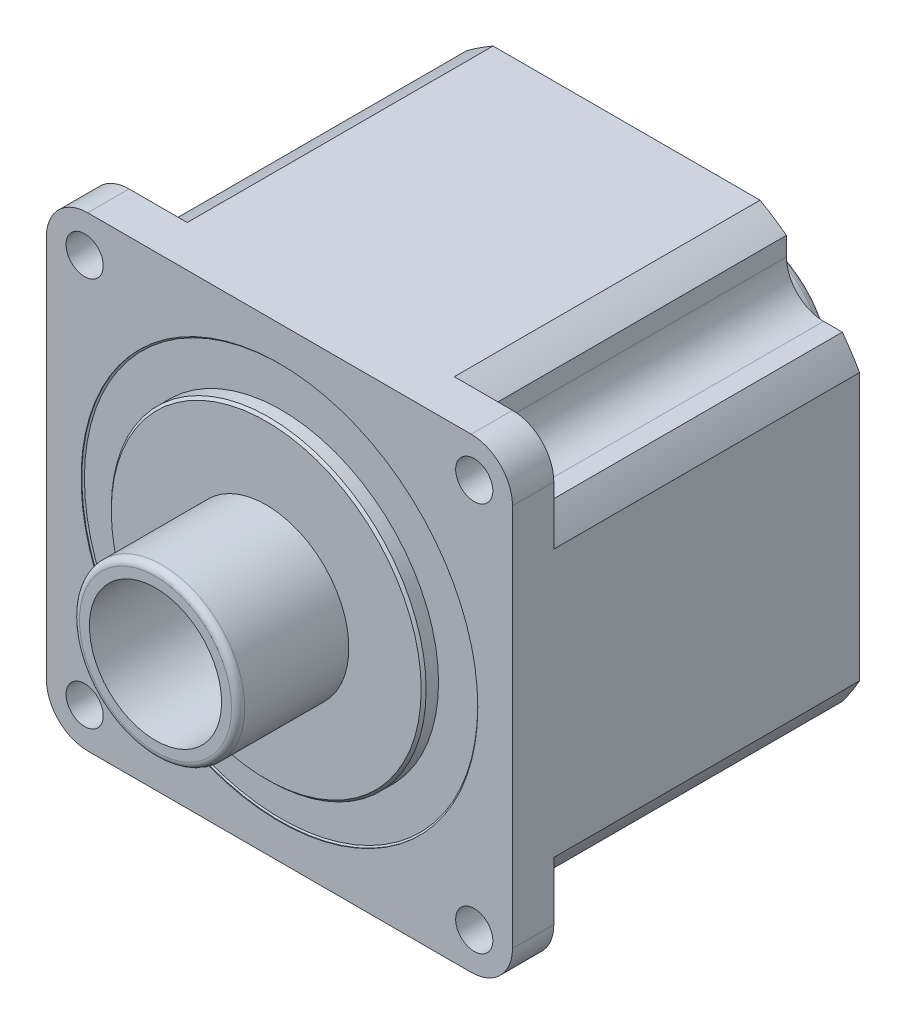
ISO-10303-21;
HEADER;
FILE_DESCRIPTION(('STEP AP214'),'2;1');
FILE_NAME('part.step','',(''),(''),'','','');
FILE_SCHEMA(('AUTOMOTIVE_DESIGN { 1 0 10303 214 1 1 1 1 }'));
ENDSEC;
DATA;
#1=APPLICATION_CONTEXT('core data for automotive mechanical design processes');
#2=APPLICATION_PROTOCOL_DEFINITION('international standard','automotive_design',2000,#1);
#3=PRODUCT_CONTEXT('',#1,'mechanical');
#4=PRODUCT('Part','Part','',(#3));
#5=PRODUCT_RELATED_PRODUCT_CATEGORY('part','',(#4));
#6=PRODUCT_DEFINITION_FORMATION('','',#4);
#7=PRODUCT_DEFINITION_CONTEXT('part definition',#1,'design');
#8=PRODUCT_DEFINITION('design','',#6,#7);
#9=PRODUCT_DEFINITION_SHAPE('','',#8);
#10=(LENGTH_UNIT() NAMED_UNIT(*) SI_UNIT(.MILLI.,.METRE.));
#11=(NAMED_UNIT(*) PLANE_ANGLE_UNIT() SI_UNIT($,.RADIAN.));
#12=(NAMED_UNIT(*) SI_UNIT($,.STERADIAN.) SOLID_ANGLE_UNIT());
#13=UNCERTAINTY_MEASURE_WITH_UNIT(LENGTH_MEASURE(1.E-05),#10,'distance_accuracy_value','');
#14=(GEOMETRIC_REPRESENTATION_CONTEXT(3) GLOBAL_UNCERTAINTY_ASSIGNED_CONTEXT((#13)) GLOBAL_UNIT_ASSIGNED_CONTEXT((#10,
#11,#12)) REPRESENTATION_CONTEXT('',''));
#15=CARTESIAN_POINT('',(0.,0.,0.));
#16=DIRECTION('',(0.,0.,1.));
#17=DIRECTION('',(1.,0.,0.));
#18=AXIS2_PLACEMENT_3D('',#15,#16,#17);
#19=CARTESIAN_POINT('',(0.,0.,-43.6));
#20=DIRECTION('',(0.,0.,-1.));
#21=DIRECTION('',(-1.,0.,0.));
#22=AXIS2_PLACEMENT_3D('',#19,#20,#21);
#23=PLANE('',#22);
#24=DIRECTION('',(0.,1.,0.));
#25=VECTOR('',#24,1.);
#26=CARTESIAN_POINT('',(-28.2,0.,-43.6));
#27=LINE('',#26,#25);
#28=CARTESIAN_POINT('',(-28.2,-16.1558039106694,-43.6));
#29=VERTEX_POINT('',#28);
#30=CARTESIAN_POINT('',(-28.2,16.1558039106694,-43.6));
#31=VERTEX_POINT('',#30);
#32=EDGE_CURVE('E259',#29,#31,#27,.T.);
#33=ORIENTED_EDGE('',*,*,#32,.T.);
#34=CARTESIAN_POINT('',(0.,0.,-43.6));
#35=DIRECTION('',(0.,0.,-1.));
#36=DIRECTION('',(-1.,0.,0.));
#37=AXIS2_PLACEMENT_3D('',#34,#35,#36);
#38=CIRCLE('',#37,32.5);
#39=CARTESIAN_POINT('',(-26.1118268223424,19.35,-43.6));
#40=VERTEX_POINT('',#39);
#41=EDGE_CURVE('E248',#31,#40,#38,.T.);
#42=ORIENTED_EDGE('',*,*,#41,.T.);
#43=DIRECTION('',(-1.,0.,0.));
#44=VECTOR('',#43,1.);
#45=CARTESIAN_POINT('',(0.,19.35,-43.6));
#46=LINE('',#45,#44);
#47=CARTESIAN_POINT('',(-23.85,19.35,-43.6));
#48=VERTEX_POINT('',#47);
#49=EDGE_CURVE('E258',#48,#40,#46,.T.);
#50=ORIENTED_EDGE('',*,*,#49,.F.);
#51=CARTESIAN_POINT('',(-23.85,23.85,-43.6));
#52=DIRECTION('',(0.,0.,-1.));
#53=DIRECTION('',(-1.,0.,0.));
#54=AXIS2_PLACEMENT_3D('',#51,#52,#53);
#55=CIRCLE('',#54,4.5);
#56=CARTESIAN_POINT('',(-19.35,23.85,-43.6));
#57=VERTEX_POINT('',#56);
#58=EDGE_CURVE('E377',#48,#57,#55,.F.);
#59=ORIENTED_EDGE('',*,*,#58,.T.);
#60=DIRECTION('',(0.,-1.,0.));
#61=VECTOR('',#60,1.);
#62=CARTESIAN_POINT('',(-19.35,0.,-43.6));
#63=LINE('',#62,#61);
#64=CARTESIAN_POINT('',(-19.35,26.1118268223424,-43.6));
#65=VERTEX_POINT('',#64);
#66=EDGE_CURVE('E588',#65,#57,#63,.T.);
#67=ORIENTED_EDGE('',*,*,#66,.F.);
#68=CARTESIAN_POINT('',(-16.1558039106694,28.2,-43.6));
#69=VERTEX_POINT('',#68);
#70=EDGE_CURVE('E262',#65,#69,#38,.T.);
#71=ORIENTED_EDGE('',*,*,#70,.T.);
#72=DIRECTION('',(1.,0.,0.));
#73=VECTOR('',#72,1.);
#74=CARTESIAN_POINT('',(0.,28.2,-43.6));
#75=LINE('',#74,#73);
#76=CARTESIAN_POINT('',(16.1558039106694,28.2,-43.6));
#77=VERTEX_POINT('',#76);
#78=EDGE_CURVE('E591',#69,#77,#75,.T.);
#79=ORIENTED_EDGE('',*,*,#78,.T.);
#80=CARTESIAN_POINT('',(19.35,26.1118268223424,-43.6));
#81=VERTEX_POINT('',#80);
#82=EDGE_CURVE('E593',#77,#81,#38,.T.);
#83=ORIENTED_EDGE('',*,*,#82,.T.);
#84=DIRECTION('',(0.,-1.,0.));
#85=VECTOR('',#84,1.);
#86=CARTESIAN_POINT('',(19.35,0.,-43.6));
#87=LINE('',#86,#85);
#88=CARTESIAN_POINT('',(19.35,23.85,-43.6));
#89=VERTEX_POINT('',#88);
#90=EDGE_CURVE('E594',#81,#89,#87,.T.);
#91=ORIENTED_EDGE('',*,*,#90,.T.);
#92=CARTESIAN_POINT('',(23.85,23.85,-43.6));
#93=DIRECTION('',(0.,0.,-1.));
#94=DIRECTION('',(-1.,0.,0.));
#95=AXIS2_PLACEMENT_3D('',#92,#93,#94);
#96=CIRCLE('',#95,4.5);
#97=CARTESIAN_POINT('',(23.85,19.35,-43.6));
#98=VERTEX_POINT('',#97);
#99=EDGE_CURVE('E379',#89,#98,#96,.F.);
#100=ORIENTED_EDGE('',*,*,#99,.T.);
#101=DIRECTION('',(-1.,0.,0.));
#102=VECTOR('',#101,1.);
#103=CARTESIAN_POINT('',(0.,19.35,-43.6));
#104=LINE('',#103,#102);
#105=CARTESIAN_POINT('',(26.1118268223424,19.35,-43.6));
#106=VERTEX_POINT('',#105);
#107=EDGE_CURVE('E596',#106,#98,#104,.T.);
#108=ORIENTED_EDGE('',*,*,#107,.F.);
#109=CARTESIAN_POINT('',(28.2,16.1558039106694,-43.6));
#110=VERTEX_POINT('',#109);
#111=EDGE_CURVE('E599',#106,#110,#38,.T.);
#112=ORIENTED_EDGE('',*,*,#111,.T.);
#113=DIRECTION('',(0.,-1.,0.));
#114=VECTOR('',#113,1.);
#115=CARTESIAN_POINT('',(28.2,0.,-43.6));
#116=LINE('',#115,#114);
#117=CARTESIAN_POINT('',(28.2,-16.1558039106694,-43.6));
#118=VERTEX_POINT('',#117);
#119=EDGE_CURVE('E600',#110,#118,#116,.T.);
#120=ORIENTED_EDGE('',*,*,#119,.T.);
#121=CARTESIAN_POINT('',(26.1118268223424,-19.35,-43.6));
#122=VERTEX_POINT('',#121);
#123=EDGE_CURVE('E602',#118,#122,#38,.T.);
#124=ORIENTED_EDGE('',*,*,#123,.T.);
#125=DIRECTION('',(-1.,0.,0.));
#126=VECTOR('',#125,1.);
#127=CARTESIAN_POINT('',(0.,-19.35,-43.6));
#128=LINE('',#127,#126);
#129=CARTESIAN_POINT('',(23.85,-19.35,-43.6));
#130=VERTEX_POINT('',#129);
#131=EDGE_CURVE('E603',#122,#130,#128,.T.);
#132=ORIENTED_EDGE('',*,*,#131,.T.);
#133=CARTESIAN_POINT('',(23.85,-23.85,-43.6));
#134=DIRECTION('',(0.,0.,-1.));
#135=DIRECTION('',(-1.,0.,0.));
#136=AXIS2_PLACEMENT_3D('',#133,#134,#135);
#137=CIRCLE('',#136,4.5);
#138=CARTESIAN_POINT('',(19.35,-23.85,-43.6));
#139=VERTEX_POINT('',#138);
#140=EDGE_CURVE('E373',#130,#139,#137,.F.);
#141=ORIENTED_EDGE('',*,*,#140,.T.);
#142=DIRECTION('',(0.,-1.,0.));
#143=VECTOR('',#142,1.);
#144=CARTESIAN_POINT('',(19.35,0.,-43.6));
#145=LINE('',#144,#143);
#146=CARTESIAN_POINT('',(19.35,-26.1118268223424,-43.6));
#147=VERTEX_POINT('',#146);
#148=EDGE_CURVE('E606',#139,#147,#145,.T.);
#149=ORIENTED_EDGE('',*,*,#148,.T.);
#150=CARTESIAN_POINT('',(16.1558039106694,-28.2,-43.6));
#151=VERTEX_POINT('',#150);
#152=EDGE_CURVE('E608',#147,#151,#38,.T.);
#153=ORIENTED_EDGE('',*,*,#152,.T.);
#154=DIRECTION('',(-1.,0.,0.));
#155=VECTOR('',#154,1.);
#156=CARTESIAN_POINT('',(0.,-28.2,-43.6));
#157=LINE('',#156,#155);
#158=CARTESIAN_POINT('',(-16.1558039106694,-28.2,-43.6));
#159=VERTEX_POINT('',#158);
#160=EDGE_CURVE('E609',#151,#159,#157,.T.);
#161=ORIENTED_EDGE('',*,*,#160,.T.);
#162=CARTESIAN_POINT('',(-19.35,-26.1118268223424,-43.6));
#163=VERTEX_POINT('',#162);
#164=EDGE_CURVE('E610',#159,#163,#38,.T.);
#165=ORIENTED_EDGE('',*,*,#164,.T.);
#166=DIRECTION('',(0.,-1.,0.));
#167=VECTOR('',#166,1.);
#168=CARTESIAN_POINT('',(-19.35,0.,-43.6));
#169=LINE('',#168,#167);
#170=CARTESIAN_POINT('',(-19.35,-23.85,-43.6));
#171=VERTEX_POINT('',#170);
#172=EDGE_CURVE('E611',#171,#163,#169,.T.);
#173=ORIENTED_EDGE('',*,*,#172,.F.);
#174=CARTESIAN_POINT('',(-23.85,-23.85,-43.6));
#175=DIRECTION('',(0.,0.,-1.));
#176=DIRECTION('',(-1.,0.,0.));
#177=AXIS2_PLACEMENT_3D('',#174,#175,#176);
#178=CIRCLE('',#177,4.5);
#179=CARTESIAN_POINT('',(-23.85,-19.35,-43.6));
#180=VERTEX_POINT('',#179);
#181=EDGE_CURVE('E375',#171,#180,#178,.F.);
#182=ORIENTED_EDGE('',*,*,#181,.T.);
#183=DIRECTION('',(-1.,0.,0.));
#184=VECTOR('',#183,1.);
#185=CARTESIAN_POINT('',(0.,-19.35,-43.6));
#186=LINE('',#185,#184);
#187=CARTESIAN_POINT('',(-26.1118268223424,-19.35,-43.6));
#188=VERTEX_POINT('',#187);
#189=EDGE_CURVE('E298',#180,#188,#186,.T.);
#190=ORIENTED_EDGE('',*,*,#189,.T.);
#191=EDGE_CURVE('E261',#188,#29,#38,.T.);
#192=ORIENTED_EDGE('',*,*,#191,.T.);
#193=EDGE_LOOP('',(#33,#42,#50,#59,#67,#71,#79,#83,#91,#100,#108,#112,#120,#124,#132,#141,#149,
#153,#161,#165,#173,#182,#190,#192));
#194=FACE_BOUND('',#193,.T.);
#195=CARTESIAN_POINT('',(0.,0.,-43.6));
#196=DIRECTION('',(0.,0.,-1.));
#197=DIRECTION('',(-1.,0.,0.));
#198=AXIS2_PLACEMENT_3D('',#195,#196,#197);
#199=CIRCLE('',#198,10.);
#200=CARTESIAN_POINT('',(-10.,0.,-43.6));
#201=VERTEX_POINT('',#200);
#202=EDGE_CURVE('E578',#201,#201,#199,.T.);
#203=ORIENTED_EDGE('',*,*,#202,.F.);
#204=EDGE_LOOP('',(#203));
#205=FACE_BOUND('',#204,.T.);
#206=ADVANCED_FACE('F37',(#194,#205),#23,.T.);
#207=CARTESIAN_POINT('',(0.,0.,13.4));
#208=DIRECTION('',(0.,0.,-1.));
#209=DIRECTION('',(-1.,0.,0.));
#210=AXIS2_PLACEMENT_3D('',#207,#208,#209);
#211=CYLINDRICAL_SURFACE('',#210,10.);
#212=CARTESIAN_POINT('',(0.,0.,12.6));
#213=DIRECTION('',(0.,0.,1.));
#214=DIRECTION('',(1.,0.,0.));
#215=AXIS2_PLACEMENT_3D('',#212,#213,#214);
#216=CIRCLE('',#215,10.);
#217=CARTESIAN_POINT('',(10.,0.,12.6));
#218=VERTEX_POINT('',#217);
#219=EDGE_CURVE('E384',#218,#218,#216,.F.);
#220=ORIENTED_EDGE('',*,*,#219,.T.);
#221=EDGE_LOOP('',(#220));
#222=FACE_BOUND('',#221,.T.);
#223=CARTESIAN_POINT('',(0.,0.,0.));
#224=DIRECTION('',(0.,0.,-1.));
#225=DIRECTION('',(-1.,0.,0.));
#226=AXIS2_PLACEMENT_3D('',#223,#224,#225);
#227=CIRCLE('',#226,10.);
#228=CARTESIAN_POINT('',(-10.,0.,0.));
#229=VERTEX_POINT('',#228);
#230=EDGE_CURVE('E696',#229,#229,#227,.T.);
#231=ORIENTED_EDGE('',*,*,#230,.F.);
#232=EDGE_LOOP('',(#231));
#233=FACE_BOUND('',#232,.T.);
#234=ADVANCED_FACE('F417',(#222,#233),#211,.T.);
#235=CARTESIAN_POINT('',(0.,0.,13.4));
#236=DIRECTION('',(0.,0.,1.));
#237=DIRECTION('',(1.,0.,0.));
#238=AXIS2_PLACEMENT_3D('',#235,#236,#237);
#239=PLANE('',#238);
#240=CARTESIAN_POINT('',(0.,0.,13.4));
#241=DIRECTION('',(0.,0.,1.));
#242=DIRECTION('',(1.,0.,0.));
#243=AXIS2_PLACEMENT_3D('',#240,#241,#242);
#244=CIRCLE('',#243,8.);
#245=CARTESIAN_POINT('',(8.,0.,13.4));
#246=VERTEX_POINT('',#245);
#247=EDGE_CURVE('E1201',#246,#246,#244,.T.);
#248=ORIENTED_EDGE('',*,*,#247,.F.);
#249=EDGE_LOOP('',(#248));
#250=FACE_BOUND('',#249,.T.);
#251=CARTESIAN_POINT('',(0.,0.,13.4));
#252=DIRECTION('',(0.,0.,1.));
#253=DIRECTION('',(1.,0.,0.));
#254=AXIS2_PLACEMENT_3D('',#251,#252,#253);
#255=CIRCLE('',#254,9.2);
#256=CARTESIAN_POINT('',(9.2,0.,13.4));
#257=VERTEX_POINT('',#256);
#258=EDGE_CURVE('E381',#257,#257,#255,.T.);
#259=ORIENTED_EDGE('',*,*,#258,.T.);
#260=EDGE_LOOP('',(#259));
#261=FACE_BOUND('',#260,.T.);
#262=ADVANCED_FACE('F422',(#250,#261),#239,.T.);
#263=CARTESIAN_POINT('',(0.,0.,0.));
#264=DIRECTION('',(0.,0.,-1.));
#265=DIRECTION('',(-1.,0.,0.));
#266=AXIS2_PLACEMENT_3D('',#263,#264,#265);
#267=PLANE('',#266);
#268=CARTESIAN_POINT('',(0.,0.,0.));
#269=DIRECTION('',(0.,0.,-1.));
#270=DIRECTION('',(-1.,0.,0.));
#271=AXIS2_PLACEMENT_3D('',#268,#269,#270);
#272=CIRCLE('',#271,18.75);
#273=CARTESIAN_POINT('',(-18.75,0.,0.));
#274=VERTEX_POINT('',#273);
#275=EDGE_CURVE('E390',#274,#274,#272,.F.);
#276=ORIENTED_EDGE('',*,*,#275,.T.);
#277=EDGE_LOOP('',(#276));
#278=FACE_BOUND('',#277,.T.);
#279=ORIENTED_EDGE('',*,*,#230,.T.);
#280=EDGE_LOOP('',(#279));
#281=FACE_BOUND('',#280,.T.);
#282=ADVANCED_FACE('F518',(#278,#281),#267,.F.);
#283=CARTESIAN_POINT('',(0.,0.,-1.6));
#284=DIRECTION('',(0.,0.,1.));
#285=DIRECTION('',(1.,0.,0.));
#286=AXIS2_PLACEMENT_3D('',#283,#284,#285);
#287=CYLINDRICAL_SURFACE('',#286,19.05);
#288=CARTESIAN_POINT('',(0.,0.,-0.300000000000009));
#289=DIRECTION('',(0.,0.,-1.));
#290=DIRECTION('',(-1.,0.,0.));
#291=AXIS2_PLACEMENT_3D('',#288,#289,#290);
#292=CIRCLE('',#291,19.05);
#293=CARTESIAN_POINT('',(-19.05,0.,-0.300000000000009));
#294=VERTEX_POINT('',#293);
#295=EDGE_CURVE('E387',#294,#294,#292,.T.);
#296=ORIENTED_EDGE('',*,*,#295,.T.);
#297=EDGE_LOOP('',(#296));
#298=FACE_BOUND('',#297,.T.);
#299=CARTESIAN_POINT('',(0.,0.,-1.8));
#300=DIRECTION('',(0.,0.,1.));
#301=DIRECTION('',(1.,0.,0.));
#302=AXIS2_PLACEMENT_3D('',#299,#300,#301);
#303=CIRCLE('',#302,19.05);
#304=CARTESIAN_POINT('',(19.05,0.,-1.8));
#305=VERTEX_POINT('',#304);
#306=EDGE_CURVE('E575',#305,#305,#303,.T.);
#307=ORIENTED_EDGE('',*,*,#306,.T.);
#308=EDGE_LOOP('',(#307));
#309=FACE_BOUND('',#308,.T.);
#310=ADVANCED_FACE('F521',(#298,#309),#287,.T.);
#311=CARTESIAN_POINT('',(0.,0.,12.6));
#312=DIRECTION('',(0.,0.,1.));
#313=DIRECTION('',(1.,0.,0.));
#314=AXIS2_PLACEMENT_3D('',#311,#312,#313);
#315=TOROIDAL_SURFACE('',#314,9.2,0.8);
#316=ORIENTED_EDGE('',*,*,#219,.F.);
#317=EDGE_LOOP('',(#316));
#318=FACE_BOUND('',#317,.T.);
#319=ORIENTED_EDGE('',*,*,#258,.F.);
#320=EDGE_LOOP('',(#319));
#321=FACE_BOUND('',#320,.T.);
#322=ADVANCED_FACE('F525',(#318,#321),#315,.T.);
#323=CARTESIAN_POINT('',(0.,0.,-1.8));
#324=DIRECTION('',(0.,0.,1.));
#325=DIRECTION('',(1.,0.,0.));
#326=AXIS2_PLACEMENT_3D('',#323,#324,#325);
#327=CYLINDRICAL_SURFACE('',#326,24.);
#328=CARTESIAN_POINT('',(0.,0.,-1.68452994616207));
#329=DIRECTION('',(0.,0.,1.));
#330=DIRECTION('',(1.,0.,0.));
#331=AXIS2_PLACEMENT_3D('',#328,#329,#330);
#332=CIRCLE('',#331,24.);
#333=CARTESIAN_POINT('',(24.,0.,-1.68452994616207));
#334=VERTEX_POINT('',#333);
#335=EDGE_CURVE('E396',#334,#334,#332,.F.);
#336=ORIENTED_EDGE('',*,*,#335,.T.);
#337=EDGE_LOOP('',(#336));
#338=FACE_BOUND('',#337,.T.);
#339=CARTESIAN_POINT('',(0.,0.,-1.6));
#340=DIRECTION('',(0.,0.,1.));
#341=DIRECTION('',(1.,0.,0.));
#342=AXIS2_PLACEMENT_3D('',#339,#340,#341);
#343=CIRCLE('',#342,24.);
#344=CARTESIAN_POINT('',(24.,0.,-1.6));
#345=VERTEX_POINT('',#344);
#346=EDGE_CURVE('E577',#345,#345,#343,.T.);
#347=ORIENTED_EDGE('',*,*,#346,.T.);
#348=EDGE_LOOP('',(#347));
#349=FACE_BOUND('',#348,.T.);
#350=ADVANCED_FACE('F427',(#338,#349),#327,.F.);
#351=CARTESIAN_POINT('',(0.,0.,-1.8));
#352=DIRECTION('',(0.,0.,1.));
#353=DIRECTION('',(1.,0.,0.));
#354=AXIS2_PLACEMENT_3D('',#351,#352,#353);
#355=PLANE('',#354);
#356=CARTESIAN_POINT('',(0.,0.,-1.8));
#357=DIRECTION('',(0.,0.,1.));
#358=DIRECTION('',(1.,0.,0.));
#359=AXIS2_PLACEMENT_3D('',#356,#357,#358);
#360=CIRCLE('',#359,23.8);
#361=CARTESIAN_POINT('',(23.8,0.,-1.8));
#362=VERTEX_POINT('',#361);
#363=EDGE_CURVE('E393',#362,#362,#360,.T.);
#364=ORIENTED_EDGE('',*,*,#363,.T.);
#365=EDGE_LOOP('',(#364));
#366=FACE_BOUND('',#365,.T.);
#367=ORIENTED_EDGE('',*,*,#306,.F.);
#368=EDGE_LOOP('',(#367));
#369=FACE_BOUND('',#368,.T.);
#370=ADVANCED_FACE('F465',(#366,#369),#355,.T.);
#371=CARTESIAN_POINT('',(-19.35,0.,-43.6));
#372=DIRECTION('',(-1.,0.,0.));
#373=DIRECTION('',(0.,0.,1.));
#374=AXIS2_PLACEMENT_3D('',#371,#372,#373);
#375=PLANE('',#374);
#376=ORIENTED_EDGE('',*,*,#66,.T.);
#377=DIRECTION('',(0.,0.,1.));
#378=VECTOR('',#377,1.);
#379=CARTESIAN_POINT('',(-19.35,23.85,-6.6));
#380=LINE('',#379,#378);
#381=CARTESIAN_POINT('',(-19.35,23.85,-6.6));
#382=VERTEX_POINT('',#381);
#383=EDGE_CURVE('E361',#57,#382,#380,.T.);
#384=ORIENTED_EDGE('',*,*,#383,.T.);
#385=DIRECTION('',(0.,-1.,0.));
#386=VECTOR('',#385,1.);
#387=CARTESIAN_POINT('',(-19.35,0.,-6.6));
#388=LINE('',#387,#386);
#389=CARTESIAN_POINT('',(-19.35,26.1118268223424,-6.6));
#390=VERTEX_POINT('',#389);
#391=EDGE_CURVE('E341',#390,#382,#388,.T.);
#392=ORIENTED_EDGE('',*,*,#391,.F.);
#393=DIRECTION('',(0.,0.,1.));
#394=VECTOR('',#393,1.);
#395=CARTESIAN_POINT('',(-19.35,26.1118268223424,-43.6));
#396=LINE('',#395,#394);
#397=EDGE_CURVE('E281',#65,#390,#396,.T.);
#398=ORIENTED_EDGE('',*,*,#397,.F.);
#399=EDGE_LOOP('',(#376,#384,#392,#398));
#400=FACE_BOUND('',#399,.T.);
#401=ADVANCED_FACE('F461',(#400),#375,.T.);
#402=CARTESIAN_POINT('',(-23.85,23.85,-43.6));
#403=DIRECTION('',(0.,0.,-1.));
#404=DIRECTION('',(-1.,0.,0.));
#405=AXIS2_PLACEMENT_3D('',#402,#403,#404);
#406=CYLINDRICAL_SURFACE('',#405,4.5);
#407=ORIENTED_EDGE('',*,*,#58,.F.);
#408=DIRECTION('',(0.,0.,1.));
#409=VECTOR('',#408,1.);
#410=CARTESIAN_POINT('',(-23.85,19.35,-43.6));
#411=LINE('',#410,#409);
#412=CARTESIAN_POINT('',(-23.85,19.35,-6.6));
#413=VERTEX_POINT('',#412);
#414=EDGE_CURVE('E366',#413,#48,#411,.F.);
#415=ORIENTED_EDGE('',*,*,#414,.F.);
#416=CARTESIAN_POINT('',(-23.85,23.85,-6.6));
#417=DIRECTION('',(0.,0.,-1.));
#418=DIRECTION('',(-1.,0.,0.));
#419=AXIS2_PLACEMENT_3D('',#416,#417,#418);
#420=CIRCLE('',#419,4.5);
#421=EDGE_CURVE('E364',#382,#413,#420,.T.);
#422=ORIENTED_EDGE('',*,*,#421,.F.);
#423=ORIENTED_EDGE('',*,*,#383,.F.);
#424=EDGE_LOOP('',(#407,#415,#422,#423));
#425=FACE_BOUND('',#424,.T.);
#426=ADVANCED_FACE('F464',(#425),#406,.F.);
#427=CARTESIAN_POINT('',(0.,19.35,-43.6));
#428=DIRECTION('',(0.,1.,0.));
#429=DIRECTION('',(0.,0.,1.));
#430=AXIS2_PLACEMENT_3D('',#427,#428,#429);
#431=PLANE('',#430);
#432=DIRECTION('',(-1.,0.,0.));
#433=VECTOR('',#432,1.);
#434=CARTESIAN_POINT('',(0.,19.35,-6.6));
#435=LINE('',#434,#433);
#436=CARTESIAN_POINT('',(-26.1118268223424,19.35,-6.6));
#437=VERTEX_POINT('',#436);
#438=EDGE_CURVE('E300',#413,#437,#435,.T.);
#439=ORIENTED_EDGE('',*,*,#438,.F.);
#440=ORIENTED_EDGE('',*,*,#414,.T.);
#441=ORIENTED_EDGE('',*,*,#49,.T.);
#442=DIRECTION('',(0.,0.,1.));
#443=VECTOR('',#442,1.);
#444=CARTESIAN_POINT('',(-26.1118268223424,19.35,-43.6));
#445=LINE('',#444,#443);
#446=EDGE_CURVE('E255',#40,#437,#445,.T.);
#447=ORIENTED_EDGE('',*,*,#446,.T.);
#448=EDGE_LOOP('',(#439,#440,#441,#447));
#449=FACE_BOUND('',#448,.T.);
#450=ADVANCED_FACE('F444',(#449),#431,.T.);
#451=CARTESIAN_POINT('',(-19.35,0.,-43.6));
#452=DIRECTION('',(-1.,0.,0.));
#453=DIRECTION('',(0.,-1.,0.));
#454=AXIS2_PLACEMENT_3D('',#451,#452,#453);
#455=PLANE('',#454);
#456=DIRECTION('',(0.,-1.,0.));
#457=VECTOR('',#456,1.);
#458=CARTESIAN_POINT('',(-19.35,0.,-6.6));
#459=LINE('',#458,#457);
#460=CARTESIAN_POINT('',(-19.35,-23.85,-6.6));
#461=VERTEX_POINT('',#460);
#462=CARTESIAN_POINT('',(-19.35,-26.1118268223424,-6.6));
#463=VERTEX_POINT('',#462);
#464=EDGE_CURVE('E773',#461,#463,#459,.T.);
#465=ORIENTED_EDGE('',*,*,#464,.F.);
#466=DIRECTION('',(0.,0.,1.));
#467=VECTOR('',#466,1.);
#468=CARTESIAN_POINT('',(-19.35,-23.85,-43.6));
#469=LINE('',#468,#467);
#470=EDGE_CURVE('E359',#461,#171,#469,.F.);
#471=ORIENTED_EDGE('',*,*,#470,.T.);
#472=ORIENTED_EDGE('',*,*,#172,.T.);
#473=DIRECTION('',(0.,0.,1.));
#474=VECTOR('',#473,1.);
#475=CARTESIAN_POINT('',(-19.35,-26.1118268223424,-43.6));
#476=LINE('',#475,#474);
#477=EDGE_CURVE('E619',#163,#463,#476,.T.);
#478=ORIENTED_EDGE('',*,*,#477,.T.);
#479=EDGE_LOOP('',(#465,#471,#472,#478));
#480=FACE_BOUND('',#479,.T.);
#481=ADVANCED_FACE('F441',(#480),#455,.T.);
#482=CARTESIAN_POINT('',(-23.85,-23.85,-43.6));
#483=DIRECTION('',(0.,0.,1.));
#484=DIRECTION('',(1.,0.,0.));
#485=AXIS2_PLACEMENT_3D('',#482,#483,#484);
#486=CYLINDRICAL_SURFACE('',#485,4.5);
#487=ORIENTED_EDGE('',*,*,#181,.F.);
#488=ORIENTED_EDGE('',*,*,#470,.F.);
#489=CARTESIAN_POINT('',(-23.85,-23.85,-6.6));
#490=DIRECTION('',(0.,0.,-1.));
#491=DIRECTION('',(-1.,0.,0.));
#492=AXIS2_PLACEMENT_3D('',#489,#490,#491);
#493=CIRCLE('',#492,4.5);
#494=CARTESIAN_POINT('',(-23.85,-19.35,-6.6));
#495=VERTEX_POINT('',#494);
#496=EDGE_CURVE('E357',#495,#461,#493,.T.);
#497=ORIENTED_EDGE('',*,*,#496,.F.);
#498=DIRECTION('',(0.,0.,1.));
#499=VECTOR('',#498,1.);
#500=CARTESIAN_POINT('',(-23.85,-19.35,-43.6));
#501=LINE('',#500,#499);
#502=EDGE_CURVE('E354',#180,#495,#501,.T.);
#503=ORIENTED_EDGE('',*,*,#502,.F.);
#504=EDGE_LOOP('',(#487,#488,#497,#503));
#505=FACE_BOUND('',#504,.T.);
#506=ADVANCED_FACE('F439',(#505),#486,.F.);
#507=CARTESIAN_POINT('',(0.,-19.35,-43.6));
#508=DIRECTION('',(0.,1.,0.));
#509=DIRECTION('',(0.,0.,1.));
#510=AXIS2_PLACEMENT_3D('',#507,#508,#509);
#511=PLANE('',#510);
#512=ORIENTED_EDGE('',*,*,#189,.F.);
#513=ORIENTED_EDGE('',*,*,#502,.T.);
#514=DIRECTION('',(-1.,0.,0.));
#515=VECTOR('',#514,1.);
#516=CARTESIAN_POINT('',(0.,-19.35,-6.6));
#517=LINE('',#516,#515);
#518=CARTESIAN_POINT('',(-26.1118268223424,-19.35,-6.6));
#519=VERTEX_POINT('',#518);
#520=EDGE_CURVE('E292',#495,#519,#517,.T.);
#521=ORIENTED_EDGE('',*,*,#520,.T.);
#522=DIRECTION('',(0.,0.,1.));
#523=VECTOR('',#522,1.);
#524=CARTESIAN_POINT('',(-26.1118268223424,-19.35,-43.6));
#525=LINE('',#524,#523);
#526=EDGE_CURVE('E617',#188,#519,#525,.T.);
#527=ORIENTED_EDGE('',*,*,#526,.F.);
#528=EDGE_LOOP('',(#512,#513,#521,#527));
#529=FACE_BOUND('',#528,.T.);
#530=ADVANCED_FACE('F435',(#529),#511,.F.);
#531=CARTESIAN_POINT('',(19.35,0.,-43.6));
#532=DIRECTION('',(-1.,0.,0.));
#533=DIRECTION('',(0.,-1.,0.));
#534=AXIS2_PLACEMENT_3D('',#531,#532,#533);
#535=PLANE('',#534);
#536=DIRECTION('',(0.,-1.,0.));
#537=VECTOR('',#536,1.);
#538=CARTESIAN_POINT('',(19.35,0.,-6.6));
#539=LINE('',#538,#537);
#540=CARTESIAN_POINT('',(19.35,26.1118268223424,-6.6));
#541=VERTEX_POINT('',#540);
#542=CARTESIAN_POINT('',(19.35,23.85,-6.6));
#543=VERTEX_POINT('',#542);
#544=EDGE_CURVE('E330',#541,#543,#539,.T.);
#545=ORIENTED_EDGE('',*,*,#544,.T.);
#546=DIRECTION('',(0.,0.,1.));
#547=VECTOR('',#546,1.);
#548=CARTESIAN_POINT('',(19.35,23.85,-43.6));
#549=LINE('',#548,#547);
#550=EDGE_CURVE('E52',#543,#89,#549,.F.);
#551=ORIENTED_EDGE('',*,*,#550,.T.);
#552=ORIENTED_EDGE('',*,*,#90,.F.);
#553=DIRECTION('',(0.,0.,1.));
#554=VECTOR('',#553,1.);
#555=CARTESIAN_POINT('',(19.35,26.1118268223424,-43.6));
#556=LINE('',#555,#554);
#557=EDGE_CURVE('E337',#81,#541,#556,.T.);
#558=ORIENTED_EDGE('',*,*,#557,.T.);
#559=EDGE_LOOP('',(#545,#551,#552,#558));
#560=FACE_BOUND('',#559,.T.);
#561=ADVANCED_FACE('F438',(#560),#535,.F.);
#562=CARTESIAN_POINT('',(23.85,23.85,-43.6));
#563=DIRECTION('',(0.,0.,1.));
#564=DIRECTION('',(1.,0.,0.));
#565=AXIS2_PLACEMENT_3D('',#562,#563,#564);
#566=CYLINDRICAL_SURFACE('',#565,4.5);
#567=ORIENTED_EDGE('',*,*,#99,.F.);
#568=ORIENTED_EDGE('',*,*,#550,.F.);
#569=CARTESIAN_POINT('',(23.85,23.85,-6.6));
#570=DIRECTION('',(0.,0.,-1.));
#571=DIRECTION('',(-1.,0.,0.));
#572=AXIS2_PLACEMENT_3D('',#569,#570,#571);
#573=CIRCLE('',#572,4.5);
#574=CARTESIAN_POINT('',(23.85,19.35,-6.6));
#575=VERTEX_POINT('',#574);
#576=EDGE_CURVE('E60',#575,#543,#573,.T.);
#577=ORIENTED_EDGE('',*,*,#576,.F.);
#578=DIRECTION('',(0.,0.,1.));
#579=VECTOR('',#578,1.);
#580=CARTESIAN_POINT('',(23.85,19.35,-43.6));
#581=LINE('',#580,#579);
#582=EDGE_CURVE('E368',#98,#575,#581,.T.);
#583=ORIENTED_EDGE('',*,*,#582,.F.);
#584=EDGE_LOOP('',(#567,#568,#577,#583));
#585=FACE_BOUND('',#584,.T.);
#586=ADVANCED_FACE('F457',(#585),#566,.F.);
#587=CARTESIAN_POINT('',(0.,19.35,-43.6));
#588=DIRECTION('',(0.,1.,0.));
#589=DIRECTION('',(-1.,0.,0.));
#590=AXIS2_PLACEMENT_3D('',#587,#588,#589);
#591=PLANE('',#590);
#592=ORIENTED_EDGE('',*,*,#107,.T.);
#593=ORIENTED_EDGE('',*,*,#582,.T.);
#594=DIRECTION('',(-1.,0.,0.));
#595=VECTOR('',#594,1.);
#596=CARTESIAN_POINT('',(0.,19.35,-6.6));
#597=LINE('',#596,#595);
#598=CARTESIAN_POINT('',(26.1118268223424,19.35,-6.6));
#599=VERTEX_POINT('',#598);
#600=EDGE_CURVE('E803',#599,#575,#597,.T.);
#601=ORIENTED_EDGE('',*,*,#600,.F.);
#602=DIRECTION('',(0.,0.,1.));
#603=VECTOR('',#602,1.);
#604=CARTESIAN_POINT('',(26.1118268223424,19.35,-43.6));
#605=LINE('',#604,#603);
#606=EDGE_CURVE('E635',#106,#599,#605,.T.);
#607=ORIENTED_EDGE('',*,*,#606,.F.);
#608=EDGE_LOOP('',(#592,#593,#601,#607));
#609=FACE_BOUND('',#608,.T.);
#610=ADVANCED_FACE('F453',(#609),#591,.T.);
#611=CARTESIAN_POINT('',(0.,-19.35,-43.6));
#612=DIRECTION('',(0.,1.,0.));
#613=DIRECTION('',(-1.,0.,0.));
#614=AXIS2_PLACEMENT_3D('',#611,#612,#613);
#615=PLANE('',#614);
#616=DIRECTION('',(-1.,0.,0.));
#617=VECTOR('',#616,1.);
#618=CARTESIAN_POINT('',(0.,-19.35,-6.6));
#619=LINE('',#618,#617);
#620=CARTESIAN_POINT('',(26.1118268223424,-19.35,-6.6));
#621=VERTEX_POINT('',#620);
#622=CARTESIAN_POINT('',(23.85,-19.35,-6.6));
#623=VERTEX_POINT('',#622);
#624=EDGE_CURVE('E774',#621,#623,#619,.T.);
#625=ORIENTED_EDGE('',*,*,#624,.T.);
#626=DIRECTION('',(0.,0.,1.));
#627=VECTOR('',#626,1.);
#628=CARTESIAN_POINT('',(23.85,-19.35,-43.6));
#629=LINE('',#628,#627);
#630=EDGE_CURVE('E352',#623,#130,#629,.F.);
#631=ORIENTED_EDGE('',*,*,#630,.T.);
#632=ORIENTED_EDGE('',*,*,#131,.F.);
#633=DIRECTION('',(0.,0.,1.));
#634=VECTOR('',#633,1.);
#635=CARTESIAN_POINT('',(26.1118268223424,-19.35,-43.6));
#636=LINE('',#635,#634);
#637=EDGE_CURVE('E630',#122,#621,#636,.T.);
#638=ORIENTED_EDGE('',*,*,#637,.T.);
#639=EDGE_LOOP('',(#625,#631,#632,#638));
#640=FACE_BOUND('',#639,.T.);
#641=ADVANCED_FACE('F450',(#640),#615,.F.);
#642=CARTESIAN_POINT('',(23.85,-23.85,-43.6));
#643=DIRECTION('',(0.,0.,-1.));
#644=DIRECTION('',(-1.,0.,0.));
#645=AXIS2_PLACEMENT_3D('',#642,#643,#644);
#646=CYLINDRICAL_SURFACE('',#645,4.5);
#647=ORIENTED_EDGE('',*,*,#140,.F.);
#648=ORIENTED_EDGE('',*,*,#630,.F.);
#649=CARTESIAN_POINT('',(23.85,-23.85,-6.6));
#650=DIRECTION('',(0.,0.,-1.));
#651=DIRECTION('',(-1.,0.,0.));
#652=AXIS2_PLACEMENT_3D('',#649,#650,#651);
#653=CIRCLE('',#652,4.5);
#654=CARTESIAN_POINT('',(19.35,-23.85,-6.6));
#655=VERTEX_POINT('',#654);
#656=EDGE_CURVE('E349',#655,#623,#653,.T.);
#657=ORIENTED_EDGE('',*,*,#656,.F.);
#658=DIRECTION('',(0.,0.,1.));
#659=VECTOR('',#658,1.);
#660=CARTESIAN_POINT('',(19.35,-23.85,-6.6));
#661=LINE('',#660,#659);
#662=EDGE_CURVE('E346',#139,#655,#661,.T.);
#663=ORIENTED_EDGE('',*,*,#662,.F.);
#664=EDGE_LOOP('',(#647,#648,#657,#663));
#665=FACE_BOUND('',#664,.T.);
#666=ADVANCED_FACE('F448',(#665),#646,.F.);
#667=CARTESIAN_POINT('',(19.35,0.,-43.6));
#668=DIRECTION('',(-1.,0.,0.));
#669=DIRECTION('',(0.,-1.,0.));
#670=AXIS2_PLACEMENT_3D('',#667,#668,#669);
#671=PLANE('',#670);
#672=ORIENTED_EDGE('',*,*,#148,.F.);
#673=ORIENTED_EDGE('',*,*,#662,.T.);
#674=DIRECTION('',(0.,-1.,0.));
#675=VECTOR('',#674,1.);
#676=CARTESIAN_POINT('',(19.35,0.,-6.6));
#677=LINE('',#676,#675);
#678=CARTESIAN_POINT('',(19.35,-26.1118268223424,-6.6));
#679=VERTEX_POINT('',#678);
#680=EDGE_CURVE('E771',#655,#679,#677,.T.);
#681=ORIENTED_EDGE('',*,*,#680,.T.);
#682=DIRECTION('',(0.,0.,1.));
#683=VECTOR('',#682,1.);
#684=CARTESIAN_POINT('',(19.35,-26.1118268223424,-43.6));
#685=LINE('',#684,#683);
#686=EDGE_CURVE('E627',#147,#679,#685,.T.);
#687=ORIENTED_EDGE('',*,*,#686,.F.);
#688=EDGE_LOOP('',(#672,#673,#681,#687));
#689=FACE_BOUND('',#688,.T.);
#690=ADVANCED_FACE('F432',(#689),#671,.F.);
#691=CARTESIAN_POINT('',(0.,0.,-43.6));
#692=DIRECTION('',(0.,0.,1.));
#693=DIRECTION('',(1.,0.,0.));
#694=AXIS2_PLACEMENT_3D('',#691,#692,#693);
#695=CYLINDRICAL_SURFACE('',#694,32.5);
#696=CARTESIAN_POINT('',(0.,0.,-6.6));
#697=DIRECTION('',(0.,0.,-1.));
#698=DIRECTION('',(-1.,0.,0.));
#699=AXIS2_PLACEMENT_3D('',#696,#697,#698);
#700=CIRCLE('',#699,32.5);
#701=CARTESIAN_POINT('',(-28.2,-16.1558039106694,-6.6));
#702=VERTEX_POINT('',#701);
#703=EDGE_CURVE('E269',#519,#702,#700,.T.);
#704=ORIENTED_EDGE('',*,*,#703,.T.);
#705=DIRECTION('',(0.,0.,1.));
#706=VECTOR('',#705,1.);
#707=CARTESIAN_POINT('',(-28.2,-16.1558039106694,-43.6));
#708=LINE('',#707,#706);
#709=EDGE_CURVE('E293',#29,#702,#708,.T.);
#710=ORIENTED_EDGE('',*,*,#709,.F.);
#711=ORIENTED_EDGE('',*,*,#191,.F.);
#712=ORIENTED_EDGE('',*,*,#526,.T.);
#713=EDGE_LOOP('',(#704,#710,#711,#712));
#714=FACE_BOUND('',#713,.T.);
#715=ADVANCED_FACE('F429',(#714),#695,.T.);
#716=CARTESIAN_POINT('',(-28.2,16.1558039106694,-6.6));
#717=VERTEX_POINT('',#716);
#718=EDGE_CURVE('E285',#717,#437,#700,.T.);
#719=ORIENTED_EDGE('',*,*,#718,.T.);
#720=ORIENTED_EDGE('',*,*,#446,.F.);
#721=ORIENTED_EDGE('',*,*,#41,.F.);
#722=DIRECTION('',(0.,0.,1.));
#723=VECTOR('',#722,1.);
#724=CARTESIAN_POINT('',(-28.2,16.1558039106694,-43.6));
#725=LINE('',#724,#723);
#726=EDGE_CURVE('E253',#31,#717,#725,.T.);
#727=ORIENTED_EDGE('',*,*,#726,.T.);
#728=EDGE_LOOP('',(#719,#720,#721,#727));
#729=FACE_BOUND('',#728,.T.);
#730=ADVANCED_FACE('F251',(#729),#695,.T.);
#731=CARTESIAN_POINT('',(-16.1558039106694,28.2,-6.6));
#732=VERTEX_POINT('',#731);
#733=EDGE_CURVE('E331',#390,#732,#700,.T.);
#734=ORIENTED_EDGE('',*,*,#733,.T.);
#735=DIRECTION('',(0.,0.,1.));
#736=VECTOR('',#735,1.);
#737=CARTESIAN_POINT('',(-16.1558039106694,28.2,-43.6));
#738=LINE('',#737,#736);
#739=EDGE_CURVE('E336',#69,#732,#738,.T.);
#740=ORIENTED_EDGE('',*,*,#739,.F.);
#741=ORIENTED_EDGE('',*,*,#70,.F.);
#742=ORIENTED_EDGE('',*,*,#397,.T.);
#743=EDGE_LOOP('',(#734,#740,#741,#742));
#744=FACE_BOUND('',#743,.T.);
#745=ADVANCED_FACE('F798',(#744),#695,.T.);
#746=CARTESIAN_POINT('',(16.1558039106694,28.2,-6.6));
#747=VERTEX_POINT('',#746);
#748=EDGE_CURVE('E326',#747,#541,#700,.T.);
#749=ORIENTED_EDGE('',*,*,#748,.T.);
#750=ORIENTED_EDGE('',*,*,#557,.F.);
#751=ORIENTED_EDGE('',*,*,#82,.F.);
#752=DIRECTION('',(0.,0.,1.));
#753=VECTOR('',#752,1.);
#754=CARTESIAN_POINT('',(16.1558039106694,28.2,-43.6));
#755=LINE('',#754,#753);
#756=EDGE_CURVE('E333',#77,#747,#755,.T.);
#757=ORIENTED_EDGE('',*,*,#756,.T.);
#758=EDGE_LOOP('',(#749,#750,#751,#757));
#759=FACE_BOUND('',#758,.T.);
#760=ADVANCED_FACE('F494',(#759),#695,.T.);
#761=CARTESIAN_POINT('',(-28.2,-28.2,-6.6));
#762=DIRECTION('',(0.,0.,-1.));
#763=DIRECTION('',(-1.,0.,0.));
#764=AXIS2_PLACEMENT_3D('',#761,#762,#763);
#765=PLANE('',#764);
#766=ORIENTED_EDGE('',*,*,#391,.T.);
#767=ORIENTED_EDGE('',*,*,#421,.T.);
#768=ORIENTED_EDGE('',*,*,#438,.T.);
#769=ORIENTED_EDGE('',*,*,#718,.F.);
#770=DIRECTION('',(0.,1.,0.));
#771=VECTOR('',#770,1.);
#772=CARTESIAN_POINT('',(-28.2,28.2,-6.6));
#773=LINE('',#772,#771);
#774=CARTESIAN_POINT('',(-28.2,23.2,-6.6));
#775=VERTEX_POINT('',#774);
#776=EDGE_CURVE('E275',#717,#775,#773,.T.);
#777=ORIENTED_EDGE('',*,*,#776,.T.);
#778=CARTESIAN_POINT('',(-23.2,23.2,-6.6));
#779=DIRECTION('',(0.,0.,-1.));
#780=DIRECTION('',(-1.,0.,0.));
#781=AXIS2_PLACEMENT_3D('',#778,#779,#780);
#782=CIRCLE('',#781,5.);
#783=CARTESIAN_POINT('',(-23.2,28.2,-6.6));
#784=VERTEX_POINT('',#783);
#785=EDGE_CURVE('E721',#775,#784,#782,.T.);
#786=ORIENTED_EDGE('',*,*,#785,.T.);
#787=DIRECTION('',(1.,0.,0.));
#788=VECTOR('',#787,1.);
#789=CARTESIAN_POINT('',(28.2,28.2,-6.6));
#790=LINE('',#789,#788);
#791=EDGE_CURVE('E738',#784,#732,#790,.T.);
#792=ORIENTED_EDGE('',*,*,#791,.T.);
#793=ORIENTED_EDGE('',*,*,#733,.F.);
#794=EDGE_LOOP('',(#766,#767,#768,#769,#777,#786,#792,#793));
#795=FACE_BOUND('',#794,.T.);
#796=CARTESIAN_POINT('',(-23.57,23.57,-6.6));
#797=DIRECTION('',(0.,0.,-1.));
#798=DIRECTION('',(-1.,0.,0.));
#799=AXIS2_PLACEMENT_3D('',#796,#797,#798);
#800=CIRCLE('',#799,2.25);
#801=CARTESIAN_POINT('',(-25.82,23.57,-6.6));
#802=VERTEX_POINT('',#801);
#803=EDGE_CURVE('E658',#802,#802,#800,.T.);
#804=ORIENTED_EDGE('',*,*,#803,.F.);
#805=EDGE_LOOP('',(#804));
#806=FACE_BOUND('',#805,.T.);
#807=ADVANCED_FACE('F490',(#795,#806),#765,.T.);
#808=CARTESIAN_POINT('',(28.2,16.1558039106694,-6.6));
#809=VERTEX_POINT('',#808);
#810=EDGE_CURVE('E322',#599,#809,#700,.T.);
#811=ORIENTED_EDGE('',*,*,#810,.T.);
#812=DIRECTION('',(0.,0.,1.));
#813=VECTOR('',#812,1.);
#814=CARTESIAN_POINT('',(28.2,16.1558039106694,-43.6));
#815=LINE('',#814,#813);
#816=EDGE_CURVE('E638',#110,#809,#815,.T.);
#817=ORIENTED_EDGE('',*,*,#816,.F.);
#818=ORIENTED_EDGE('',*,*,#111,.F.);
#819=ORIENTED_EDGE('',*,*,#606,.T.);
#820=EDGE_LOOP('',(#811,#817,#818,#819));
#821=FACE_BOUND('',#820,.T.);
#822=ADVANCED_FACE('F493',(#821),#695,.T.);
#823=CARTESIAN_POINT('',(28.2,-16.1558039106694,-6.6));
#824=VERTEX_POINT('',#823);
#825=EDGE_CURVE('E318',#824,#621,#700,.T.);
#826=ORIENTED_EDGE('',*,*,#825,.T.);
#827=ORIENTED_EDGE('',*,*,#637,.F.);
#828=ORIENTED_EDGE('',*,*,#123,.F.);
#829=DIRECTION('',(0.,0.,1.));
#830=VECTOR('',#829,1.);
#831=CARTESIAN_POINT('',(28.2,-16.1558039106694,-43.6));
#832=LINE('',#831,#830);
#833=EDGE_CURVE('E634',#118,#824,#832,.T.);
#834=ORIENTED_EDGE('',*,*,#833,.T.);
#835=EDGE_LOOP('',(#826,#827,#828,#834));
#836=FACE_BOUND('',#835,.T.);
#837=ADVANCED_FACE('F812',(#836),#695,.T.);
#838=CARTESIAN_POINT('',(16.1558039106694,-28.2,-6.6));
#839=VERTEX_POINT('',#838);
#840=EDGE_CURVE('E313',#679,#839,#700,.T.);
#841=ORIENTED_EDGE('',*,*,#840,.T.);
#842=DIRECTION('',(0.,0.,1.));
#843=VECTOR('',#842,1.);
#844=CARTESIAN_POINT('',(16.1558039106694,-28.2,-43.6));
#845=LINE('',#844,#843);
#846=EDGE_CURVE('E631',#151,#839,#845,.T.);
#847=ORIENTED_EDGE('',*,*,#846,.F.);
#848=ORIENTED_EDGE('',*,*,#152,.F.);
#849=ORIENTED_EDGE('',*,*,#686,.T.);
#850=EDGE_LOOP('',(#841,#847,#848,#849));
#851=FACE_BOUND('',#850,.T.);
#852=ADVANCED_FACE('F768',(#851),#695,.T.);
#853=CARTESIAN_POINT('',(-16.1558039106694,-28.2,-6.6));
#854=VERTEX_POINT('',#853);
#855=EDGE_CURVE('E309',#854,#463,#700,.T.);
#856=ORIENTED_EDGE('',*,*,#855,.T.);
#857=ORIENTED_EDGE('',*,*,#477,.F.);
#858=ORIENTED_EDGE('',*,*,#164,.F.);
#859=DIRECTION('',(0.,0.,1.));
#860=VECTOR('',#859,1.);
#861=CARTESIAN_POINT('',(-16.1558039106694,-28.2,-43.6));
#862=LINE('',#861,#860);
#863=EDGE_CURVE('E622',#159,#854,#862,.T.);
#864=ORIENTED_EDGE('',*,*,#863,.T.);
#865=EDGE_LOOP('',(#856,#857,#858,#864));
#866=FACE_BOUND('',#865,.T.);
#867=ADVANCED_FACE('F434',(#866),#695,.T.);
#868=ORIENTED_EDGE('',*,*,#520,.F.);
#869=ORIENTED_EDGE('',*,*,#496,.T.);
#870=ORIENTED_EDGE('',*,*,#464,.T.);
#871=ORIENTED_EDGE('',*,*,#855,.F.);
#872=DIRECTION('',(-1.,0.,0.));
#873=VECTOR('',#872,1.);
#874=CARTESIAN_POINT('',(28.2,-28.2,-6.6));
#875=LINE('',#874,#873);
#876=CARTESIAN_POINT('',(-23.2,-28.2,-6.6));
#877=VERTEX_POINT('',#876);
#878=EDGE_CURVE('E675',#854,#877,#875,.T.);
#879=ORIENTED_EDGE('',*,*,#878,.T.);
#880=CARTESIAN_POINT('',(-23.2,-23.2,-6.6));
#881=DIRECTION('',(0.,0.,-1.));
#882=DIRECTION('',(-1.,0.,0.));
#883=AXIS2_PLACEMENT_3D('',#880,#881,#882);
#884=CIRCLE('',#883,5.);
#885=CARTESIAN_POINT('',(-28.2,-23.2,-6.6));
#886=VERTEX_POINT('',#885);
#887=EDGE_CURVE('E723',#877,#886,#884,.T.);
#888=ORIENTED_EDGE('',*,*,#887,.T.);
#889=EDGE_CURVE('E672',#886,#702,#773,.T.);
#890=ORIENTED_EDGE('',*,*,#889,.T.);
#891=ORIENTED_EDGE('',*,*,#703,.F.);
#892=EDGE_LOOP('',(#868,#869,#870,#871,#879,#888,#890,#891));
#893=FACE_BOUND('',#892,.T.);
#894=CARTESIAN_POINT('',(-23.57,-23.57,-6.6));
#895=DIRECTION('',(0.,0.,-1.));
#896=DIRECTION('',(-1.,0.,0.));
#897=AXIS2_PLACEMENT_3D('',#894,#895,#896);
#898=CIRCLE('',#897,2.25);
#899=CARTESIAN_POINT('',(-25.82,-23.57,-6.6));
#900=VERTEX_POINT('',#899);
#901=EDGE_CURVE('E646',#900,#900,#898,.T.);
#902=ORIENTED_EDGE('',*,*,#901,.F.);
#903=EDGE_LOOP('',(#902));
#904=FACE_BOUND('',#903,.T.);
#905=ADVANCED_FACE('F496',(#893,#904),#765,.T.);
#906=ORIENTED_EDGE('',*,*,#600,.T.);
#907=ORIENTED_EDGE('',*,*,#576,.T.);
#908=ORIENTED_EDGE('',*,*,#544,.F.);
#909=ORIENTED_EDGE('',*,*,#748,.F.);
#910=CARTESIAN_POINT('',(23.2,28.2,-6.6));
#911=VERTEX_POINT('',#910);
#912=EDGE_CURVE('E674',#747,#911,#790,.T.);
#913=ORIENTED_EDGE('',*,*,#912,.T.);
#914=CARTESIAN_POINT('',(23.2,23.2,-6.6));
#915=DIRECTION('',(0.,0.,-1.));
#916=DIRECTION('',(-1.,0.,0.));
#917=AXIS2_PLACEMENT_3D('',#914,#915,#916);
#918=CIRCLE('',#917,5.);
#919=CARTESIAN_POINT('',(28.2,23.2,-6.6));
#920=VERTEX_POINT('',#919);
#921=EDGE_CURVE('E719',#911,#920,#918,.T.);
#922=ORIENTED_EDGE('',*,*,#921,.T.);
#923=DIRECTION('',(0.,-1.,0.));
#924=VECTOR('',#923,1.);
#925=CARTESIAN_POINT('',(28.2,28.2,-6.6));
#926=LINE('',#925,#924);
#927=EDGE_CURVE('E679',#920,#809,#926,.T.);
#928=ORIENTED_EDGE('',*,*,#927,.T.);
#929=ORIENTED_EDGE('',*,*,#810,.F.);
#930=EDGE_LOOP('',(#906,#907,#908,#909,#913,#922,#928,#929));
#931=FACE_BOUND('',#930,.T.);
#932=CARTESIAN_POINT('',(23.57,23.57,-6.6));
#933=DIRECTION('',(0.,0.,-1.));
#934=DIRECTION('',(-1.,0.,0.));
#935=AXIS2_PLACEMENT_3D('',#932,#933,#934);
#936=CIRCLE('',#935,2.25);
#937=CARTESIAN_POINT('',(21.32,23.57,-6.6));
#938=VERTEX_POINT('',#937);
#939=EDGE_CURVE('E652',#938,#938,#936,.T.);
#940=ORIENTED_EDGE('',*,*,#939,.F.);
#941=EDGE_LOOP('',(#940));
#942=FACE_BOUND('',#941,.T.);
#943=ADVANCED_FACE('F497',(#931,#942),#765,.T.);
#944=ORIENTED_EDGE('',*,*,#680,.F.);
#945=ORIENTED_EDGE('',*,*,#656,.T.);
#946=ORIENTED_EDGE('',*,*,#624,.F.);
#947=ORIENTED_EDGE('',*,*,#825,.F.);
#948=CARTESIAN_POINT('',(28.2,-23.2,-6.6));
#949=VERTEX_POINT('',#948);
#950=EDGE_CURVE('E737',#824,#949,#926,.T.);
#951=ORIENTED_EDGE('',*,*,#950,.T.);
#952=CARTESIAN_POINT('',(23.2,-23.2,-6.6));
#953=DIRECTION('',(0.,0.,-1.));
#954=DIRECTION('',(-1.,0.,0.));
#955=AXIS2_PLACEMENT_3D('',#952,#953,#954);
#956=CIRCLE('',#955,5.);
#957=CARTESIAN_POINT('',(23.2,-28.2,-6.6));
#958=VERTEX_POINT('',#957);
#959=EDGE_CURVE('E725',#949,#958,#956,.T.);
#960=ORIENTED_EDGE('',*,*,#959,.T.);
#961=EDGE_CURVE('E678',#958,#839,#875,.T.);
#962=ORIENTED_EDGE('',*,*,#961,.T.);
#963=ORIENTED_EDGE('',*,*,#840,.F.);
#964=EDGE_LOOP('',(#944,#945,#946,#947,#951,#960,#962,#963));
#965=FACE_BOUND('',#964,.T.);
#966=CARTESIAN_POINT('',(23.57,-23.57,-6.6));
#967=DIRECTION('',(0.,0.,-1.));
#968=DIRECTION('',(-1.,0.,0.));
#969=AXIS2_PLACEMENT_3D('',#966,#967,#968);
#970=CIRCLE('',#969,2.25);
#971=CARTESIAN_POINT('',(21.32,-23.57,-6.6));
#972=VERTEX_POINT('',#971);
#973=EDGE_CURVE('E279',#972,#972,#970,.T.);
#974=ORIENTED_EDGE('',*,*,#973,.F.);
#975=EDGE_LOOP('',(#974));
#976=FACE_BOUND('',#975,.T.);
#977=ADVANCED_FACE('F480',(#965,#976),#765,.T.);
#978=CARTESIAN_POINT('',(-23.57,-23.57,-6.6));
#979=DIRECTION('',(0.,0.,1.));
#980=DIRECTION('',(1.,0.,0.));
#981=AXIS2_PLACEMENT_3D('',#978,#979,#980);
#982=CYLINDRICAL_SURFACE('',#981,2.25);
#983=ORIENTED_EDGE('',*,*,#901,.T.);
#984=EDGE_LOOP('',(#983));
#985=FACE_BOUND('',#984,.T.);
#986=CARTESIAN_POINT('',(-23.57,-23.57,-1.6));
#987=DIRECTION('',(0.,0.,-1.));
#988=DIRECTION('',(-1.,0.,0.));
#989=AXIS2_PLACEMENT_3D('',#986,#987,#988);
#990=CIRCLE('',#989,2.25);
#991=CARTESIAN_POINT('',(-25.82,-23.57,-1.6));
#992=VERTEX_POINT('',#991);
#993=EDGE_CURVE('E644',#992,#992,#990,.T.);
#994=ORIENTED_EDGE('',*,*,#993,.F.);
#995=EDGE_LOOP('',(#994));
#996=FACE_BOUND('',#995,.T.);
#997=ADVANCED_FACE('F476',(#985,#996),#982,.F.);
#998=CARTESIAN_POINT('',(-23.57,23.57,-6.6));
#999=DIRECTION('',(0.,0.,1.));
#1000=DIRECTION('',(1.,0.,0.));
#1001=AXIS2_PLACEMENT_3D('',#998,#999,#1000);
#1002=CYLINDRICAL_SURFACE('',#1001,2.25);
#1003=ORIENTED_EDGE('',*,*,#803,.T.);
#1004=EDGE_LOOP('',(#1003));
#1005=FACE_BOUND('',#1004,.T.);
#1006=CARTESIAN_POINT('',(-23.57,23.57,-1.6));
#1007=DIRECTION('',(0.,0.,-1.));
#1008=DIRECTION('',(-1.,0.,0.));
#1009=AXIS2_PLACEMENT_3D('',#1006,#1007,#1008);
#1010=CIRCLE('',#1009,2.25);
#1011=CARTESIAN_POINT('',(-25.82,23.57,-1.6));
#1012=VERTEX_POINT('',#1011);
#1013=EDGE_CURVE('E655',#1012,#1012,#1010,.T.);
#1014=ORIENTED_EDGE('',*,*,#1013,.F.);
#1015=EDGE_LOOP('',(#1014));
#1016=FACE_BOUND('',#1015,.T.);
#1017=ADVANCED_FACE('F479',(#1005,#1016),#1002,.F.);
#1018=CARTESIAN_POINT('',(-23.2,-23.2,-6.6));
#1019=DIRECTION('',(0.,0.,1.));
#1020=DIRECTION('',(1.,0.,0.));
#1021=AXIS2_PLACEMENT_3D('',#1018,#1019,#1020);
#1022=CYLINDRICAL_SURFACE('',#1021,5.);
#1023=ORIENTED_EDGE('',*,*,#887,.F.);
#1024=DIRECTION('',(0.,0.,1.));
#1025=VECTOR('',#1024,1.);
#1026=CARTESIAN_POINT('',(-23.2,-28.2,-6.6));
#1027=LINE('',#1026,#1025);
#1028=CARTESIAN_POINT('',(-23.2,-28.2,-1.6));
#1029=VERTEX_POINT('',#1028);
#1030=EDGE_CURVE('E699',#1029,#877,#1027,.F.);
#1031=ORIENTED_EDGE('',*,*,#1030,.F.);
#1032=CARTESIAN_POINT('',(-23.2,-23.2,-1.6));
#1033=DIRECTION('',(0.,0.,-1.));
#1034=DIRECTION('',(-1.,0.,0.));
#1035=AXIS2_PLACEMENT_3D('',#1032,#1033,#1034);
#1036=CIRCLE('',#1035,5.);
#1037=CARTESIAN_POINT('',(-28.2,-23.2,-1.6));
#1038=VERTEX_POINT('',#1037);
#1039=EDGE_CURVE('E709',#1038,#1029,#1036,.F.);
#1040=ORIENTED_EDGE('',*,*,#1039,.F.);
#1041=DIRECTION('',(0.,0.,1.));
#1042=VECTOR('',#1041,1.);
#1043=CARTESIAN_POINT('',(-28.2,-23.2,-6.6));
#1044=LINE('',#1043,#1042);
#1045=EDGE_CURVE('E729',#886,#1038,#1044,.T.);
#1046=ORIENTED_EDGE('',*,*,#1045,.F.);
#1047=EDGE_LOOP('',(#1023,#1031,#1040,#1046));
#1048=FACE_BOUND('',#1047,.T.);
#1049=ADVANCED_FACE('F488',(#1048),#1022,.T.);
#1050=CARTESIAN_POINT('',(-28.2,28.2,-6.6));
#1051=DIRECTION('',(1.,0.,0.));
#1052=DIRECTION('',(0.,1.,0.));
#1053=AXIS2_PLACEMENT_3D('',#1050,#1051,#1052);
#1054=PLANE('',#1053);
#1055=ORIENTED_EDGE('',*,*,#889,.F.);
#1056=ORIENTED_EDGE('',*,*,#1045,.T.);
#1057=DIRECTION('',(0.,1.,0.));
#1058=VECTOR('',#1057,1.);
#1059=CARTESIAN_POINT('',(-28.2,28.2,-1.6));
#1060=LINE('',#1059,#1058);
#1061=CARTESIAN_POINT('',(-28.2,23.2,-1.6));
#1062=VERTEX_POINT('',#1061);
#1063=EDGE_CURVE('E661',#1038,#1062,#1060,.T.);
#1064=ORIENTED_EDGE('',*,*,#1063,.T.);
#1065=DIRECTION('',(0.,0.,1.));
#1066=VECTOR('',#1065,1.);
#1067=CARTESIAN_POINT('',(-28.2,23.2,-6.6));
#1068=LINE('',#1067,#1066);
#1069=EDGE_CURVE('E727',#1062,#775,#1068,.F.);
#1070=ORIENTED_EDGE('',*,*,#1069,.T.);
#1071=ORIENTED_EDGE('',*,*,#776,.F.);
#1072=ORIENTED_EDGE('',*,*,#726,.F.);
#1073=ORIENTED_EDGE('',*,*,#32,.F.);
#1074=ORIENTED_EDGE('',*,*,#709,.T.);
#1075=EDGE_LOOP('',(#1055,#1056,#1064,#1070,#1071,#1072,#1073,#1074));
#1076=FACE_BOUND('',#1075,.T.);
#1077=ADVANCED_FACE('F273',(#1076),#1054,.F.);
#1078=CARTESIAN_POINT('',(-23.2,23.2,-6.6));
#1079=DIRECTION('',(0.,0.,1.));
#1080=DIRECTION('',(1.,0.,0.));
#1081=AXIS2_PLACEMENT_3D('',#1078,#1079,#1080);
#1082=CYLINDRICAL_SURFACE('',#1081,5.);
#1083=ORIENTED_EDGE('',*,*,#785,.F.);
#1084=ORIENTED_EDGE('',*,*,#1069,.F.);
#1085=CARTESIAN_POINT('',(-23.2,23.2,-1.6));
#1086=DIRECTION('',(0.,0.,-1.));
#1087=DIRECTION('',(-1.,0.,0.));
#1088=AXIS2_PLACEMENT_3D('',#1085,#1086,#1087);
#1089=CIRCLE('',#1088,5.);
#1090=CARTESIAN_POINT('',(-23.2,28.2,-1.6));
#1091=VERTEX_POINT('',#1090);
#1092=EDGE_CURVE('E707',#1091,#1062,#1089,.F.);
#1093=ORIENTED_EDGE('',*,*,#1092,.F.);
#1094=DIRECTION('',(0.,0.,1.));
#1095=VECTOR('',#1094,1.);
#1096=CARTESIAN_POINT('',(-23.2,28.2,-6.6));
#1097=LINE('',#1096,#1095);
#1098=EDGE_CURVE('E350',#784,#1091,#1097,.T.);
#1099=ORIENTED_EDGE('',*,*,#1098,.F.);
#1100=EDGE_LOOP('',(#1083,#1084,#1093,#1099));
#1101=FACE_BOUND('',#1100,.T.);
#1102=ADVANCED_FACE('F514',(#1101),#1082,.T.);
#1103=CARTESIAN_POINT('',(28.2,28.2,-6.6));
#1104=DIRECTION('',(0.,-1.,0.));
#1105=DIRECTION('',(0.,0.,-1.));
#1106=AXIS2_PLACEMENT_3D('',#1103,#1104,#1105);
#1107=PLANE('',#1106);
#1108=ORIENTED_EDGE('',*,*,#791,.F.);
#1109=ORIENTED_EDGE('',*,*,#1098,.T.);
#1110=DIRECTION('',(1.,0.,0.));
#1111=VECTOR('',#1110,1.);
#1112=CARTESIAN_POINT('',(28.2,28.2,-1.6));
#1113=LINE('',#1112,#1111);
#1114=CARTESIAN_POINT('',(23.2,28.2,-1.6));
#1115=VERTEX_POINT('',#1114);
#1116=EDGE_CURVE('E687',#1091,#1115,#1113,.T.);
#1117=ORIENTED_EDGE('',*,*,#1116,.T.);
#1118=DIRECTION('',(0.,0.,1.));
#1119=VECTOR('',#1118,1.);
#1120=CARTESIAN_POINT('',(23.2,28.2,-6.6));
#1121=LINE('',#1120,#1119);
#1122=EDGE_CURVE('E732',#1115,#911,#1121,.F.);
#1123=ORIENTED_EDGE('',*,*,#1122,.T.);
#1124=ORIENTED_EDGE('',*,*,#912,.F.);
#1125=ORIENTED_EDGE('',*,*,#756,.F.);
#1126=ORIENTED_EDGE('',*,*,#78,.F.);
#1127=ORIENTED_EDGE('',*,*,#739,.T.);
#1128=EDGE_LOOP('',(#1108,#1109,#1117,#1123,#1124,#1125,#1126,#1127));
#1129=FACE_BOUND('',#1128,.T.);
#1130=ADVANCED_FACE('F511',(#1129),#1107,.F.);
#1131=CARTESIAN_POINT('',(23.2,23.2,-6.6));
#1132=DIRECTION('',(0.,0.,1.));
#1133=DIRECTION('',(1.,0.,0.));
#1134=AXIS2_PLACEMENT_3D('',#1131,#1132,#1133);
#1135=CYLINDRICAL_SURFACE('',#1134,5.);
#1136=ORIENTED_EDGE('',*,*,#921,.F.);
#1137=ORIENTED_EDGE('',*,*,#1122,.F.);
#1138=CARTESIAN_POINT('',(23.2,23.2,-1.6));
#1139=DIRECTION('',(0.,0.,-1.));
#1140=DIRECTION('',(-1.,0.,0.));
#1141=AXIS2_PLACEMENT_3D('',#1138,#1139,#1140);
#1142=CIRCLE('',#1141,5.);
#1143=CARTESIAN_POINT('',(28.2,23.2,-1.6));
#1144=VERTEX_POINT('',#1143);
#1145=EDGE_CURVE('E705',#1144,#1115,#1142,.F.);
#1146=ORIENTED_EDGE('',*,*,#1145,.F.);
#1147=DIRECTION('',(0.,0.,1.));
#1148=VECTOR('',#1147,1.);
#1149=CARTESIAN_POINT('',(28.2,23.2,-6.6));
#1150=LINE('',#1149,#1148);
#1151=EDGE_CURVE('E713',#920,#1144,#1150,.T.);
#1152=ORIENTED_EDGE('',*,*,#1151,.F.);
#1153=EDGE_LOOP('',(#1136,#1137,#1146,#1152));
#1154=FACE_BOUND('',#1153,.T.);
#1155=ADVANCED_FACE('F509',(#1154),#1135,.T.);
#1156=CARTESIAN_POINT('',(28.2,28.2,-6.6));
#1157=DIRECTION('',(-1.,0.,0.));
#1158=DIRECTION('',(0.,-1.,0.));
#1159=AXIS2_PLACEMENT_3D('',#1156,#1157,#1158);
#1160=PLANE('',#1159);
#1161=DIRECTION('',(0.,-1.,0.));
#1162=VECTOR('',#1161,1.);
#1163=CARTESIAN_POINT('',(28.2,28.2,-1.6));
#1164=LINE('',#1163,#1162);
#1165=CARTESIAN_POINT('',(28.2,-23.2,-1.6));
#1166=VERTEX_POINT('',#1165);
#1167=EDGE_CURVE('E690',#1144,#1166,#1164,.T.);
#1168=ORIENTED_EDGE('',*,*,#1167,.T.);
#1169=DIRECTION('',(0.,0.,1.));
#1170=VECTOR('',#1169,1.);
#1171=CARTESIAN_POINT('',(28.2,-23.2,-6.6));
#1172=LINE('',#1171,#1170);
#1173=EDGE_CURVE('E716',#1166,#949,#1172,.F.);
#1174=ORIENTED_EDGE('',*,*,#1173,.T.);
#1175=ORIENTED_EDGE('',*,*,#950,.F.);
#1176=ORIENTED_EDGE('',*,*,#833,.F.);
#1177=ORIENTED_EDGE('',*,*,#119,.F.);
#1178=ORIENTED_EDGE('',*,*,#816,.T.);
#1179=ORIENTED_EDGE('',*,*,#927,.F.);
#1180=ORIENTED_EDGE('',*,*,#1151,.T.);
#1181=EDGE_LOOP('',(#1168,#1174,#1175,#1176,#1177,#1178,#1179,#1180));
#1182=FACE_BOUND('',#1181,.T.);
#1183=ADVANCED_FACE('F506',(#1182),#1160,.F.);
#1184=CARTESIAN_POINT('',(23.2,-23.2,-6.6));
#1185=DIRECTION('',(0.,0.,1.));
#1186=DIRECTION('',(1.,0.,0.));
#1187=AXIS2_PLACEMENT_3D('',#1184,#1185,#1186);
#1188=CYLINDRICAL_SURFACE('',#1187,5.);
#1189=ORIENTED_EDGE('',*,*,#959,.F.);
#1190=ORIENTED_EDGE('',*,*,#1173,.F.);
#1191=CARTESIAN_POINT('',(23.2,-23.2,-1.6));
#1192=DIRECTION('',(0.,0.,-1.));
#1193=DIRECTION('',(-1.,0.,0.));
#1194=AXIS2_PLACEMENT_3D('',#1191,#1192,#1193);
#1195=CIRCLE('',#1194,5.);
#1196=CARTESIAN_POINT('',(23.2,-28.2,-1.6));
#1197=VERTEX_POINT('',#1196);
#1198=EDGE_CURVE('E711',#1197,#1166,#1195,.F.);
#1199=ORIENTED_EDGE('',*,*,#1198,.F.);
#1200=DIRECTION('',(0.,0.,1.));
#1201=VECTOR('',#1200,1.);
#1202=CARTESIAN_POINT('',(23.2,-28.2,-6.6));
#1203=LINE('',#1202,#1201);
#1204=EDGE_CURVE('E702',#958,#1197,#1203,.T.);
#1205=ORIENTED_EDGE('',*,*,#1204,.F.);
#1206=EDGE_LOOP('',(#1189,#1190,#1199,#1205));
#1207=FACE_BOUND('',#1206,.T.);
#1208=ADVANCED_FACE('F504',(#1207),#1188,.T.);
#1209=CARTESIAN_POINT('',(28.2,-28.2,-6.6));
#1210=DIRECTION('',(0.,1.,0.));
#1211=DIRECTION('',(0.,0.,1.));
#1212=AXIS2_PLACEMENT_3D('',#1209,#1210,#1211);
#1213=PLANE('',#1212);
#1214=ORIENTED_EDGE('',*,*,#961,.F.);
#1215=ORIENTED_EDGE('',*,*,#1204,.T.);
#1216=DIRECTION('',(-1.,0.,0.));
#1217=VECTOR('',#1216,1.);
#1218=CARTESIAN_POINT('',(28.2,-28.2,-1.6));
#1219=LINE('',#1218,#1217);
#1220=EDGE_CURVE('E693',#1197,#1029,#1219,.T.);
#1221=ORIENTED_EDGE('',*,*,#1220,.T.);
#1222=ORIENTED_EDGE('',*,*,#1030,.T.);
#1223=ORIENTED_EDGE('',*,*,#878,.F.);
#1224=ORIENTED_EDGE('',*,*,#863,.F.);
#1225=ORIENTED_EDGE('',*,*,#160,.F.);
#1226=ORIENTED_EDGE('',*,*,#846,.T.);
#1227=EDGE_LOOP('',(#1214,#1215,#1221,#1222,#1223,#1224,#1225,#1226));
#1228=FACE_BOUND('',#1227,.T.);
#1229=ADVANCED_FACE('F484',(#1228),#1213,.F.);
#1230=CARTESIAN_POINT('',(23.57,23.57,-6.6));
#1231=DIRECTION('',(0.,0.,1.));
#1232=DIRECTION('',(1.,0.,0.));
#1233=AXIS2_PLACEMENT_3D('',#1230,#1231,#1232);
#1234=CYLINDRICAL_SURFACE('',#1233,2.25);
#1235=ORIENTED_EDGE('',*,*,#939,.T.);
#1236=EDGE_LOOP('',(#1235));
#1237=FACE_BOUND('',#1236,.T.);
#1238=CARTESIAN_POINT('',(23.57,23.57,-1.6));
#1239=DIRECTION('',(0.,0.,-1.));
#1240=DIRECTION('',(-1.,0.,0.));
#1241=AXIS2_PLACEMENT_3D('',#1238,#1239,#1240);
#1242=CIRCLE('',#1241,2.25);
#1243=CARTESIAN_POINT('',(21.32,23.57,-1.6));
#1244=VERTEX_POINT('',#1243);
#1245=EDGE_CURVE('E649',#1244,#1244,#1242,.T.);
#1246=ORIENTED_EDGE('',*,*,#1245,.F.);
#1247=EDGE_LOOP('',(#1246));
#1248=FACE_BOUND('',#1247,.T.);
#1249=ADVANCED_FACE('F474',(#1237,#1248),#1234,.F.);
#1250=CARTESIAN_POINT('',(23.57,-23.57,-6.6));
#1251=DIRECTION('',(0.,0.,1.));
#1252=DIRECTION('',(1.,0.,0.));
#1253=AXIS2_PLACEMENT_3D('',#1250,#1251,#1252);
#1254=CYLINDRICAL_SURFACE('',#1253,2.25);
#1255=ORIENTED_EDGE('',*,*,#973,.T.);
#1256=EDGE_LOOP('',(#1255));
#1257=FACE_BOUND('',#1256,.T.);
#1258=CARTESIAN_POINT('',(23.57,-23.57,-1.6));
#1259=DIRECTION('',(0.,0.,-1.));
#1260=DIRECTION('',(-1.,0.,0.));
#1261=AXIS2_PLACEMENT_3D('',#1258,#1259,#1260);
#1262=CIRCLE('',#1261,2.25);
#1263=CARTESIAN_POINT('',(21.32,-23.57,-1.6));
#1264=VERTEX_POINT('',#1263);
#1265=EDGE_CURVE('E276',#1264,#1264,#1262,.T.);
#1266=ORIENTED_EDGE('',*,*,#1265,.F.);
#1267=EDGE_LOOP('',(#1266));
#1268=FACE_BOUND('',#1267,.T.);
#1269=ADVANCED_FACE('F470',(#1257,#1268),#1254,.F.);
#1270=CARTESIAN_POINT('',(-28.2,-28.2,-1.6));
#1271=DIRECTION('',(0.,0.,-1.));
#1272=DIRECTION('',(-1.,0.,0.));
#1273=AXIS2_PLACEMENT_3D('',#1270,#1271,#1272);
#1274=PLANE('',#1273);
#1275=ORIENTED_EDGE('',*,*,#346,.F.);
#1276=EDGE_LOOP('',(#1275));
#1277=FACE_BOUND('',#1276,.T.);
#1278=ORIENTED_EDGE('',*,*,#1265,.T.);
#1279=EDGE_LOOP('',(#1278));
#1280=FACE_BOUND('',#1279,.T.);
#1281=ORIENTED_EDGE('',*,*,#1245,.T.);
#1282=EDGE_LOOP('',(#1281));
#1283=FACE_BOUND('',#1282,.T.);
#1284=ORIENTED_EDGE('',*,*,#1220,.F.);
#1285=ORIENTED_EDGE('',*,*,#1198,.T.);
#1286=ORIENTED_EDGE('',*,*,#1167,.F.);
#1287=ORIENTED_EDGE('',*,*,#1145,.T.);
#1288=ORIENTED_EDGE('',*,*,#1116,.F.);
#1289=ORIENTED_EDGE('',*,*,#1092,.T.);
#1290=ORIENTED_EDGE('',*,*,#1063,.F.);
#1291=ORIENTED_EDGE('',*,*,#1039,.T.);
#1292=EDGE_LOOP('',(#1284,#1285,#1286,#1287,#1288,#1289,#1290,#1291));
#1293=FACE_BOUND('',#1292,.T.);
#1294=ORIENTED_EDGE('',*,*,#1013,.T.);
#1295=EDGE_LOOP('',(#1294));
#1296=FACE_BOUND('',#1295,.T.);
#1297=ORIENTED_EDGE('',*,*,#993,.T.);
#1298=EDGE_LOOP('',(#1297));
#1299=FACE_BOUND('',#1298,.T.);
#1300=ADVANCED_FACE('F473',(#1277,#1280,#1283,#1293,#1296,#1299),#1274,.F.);
#1301=CARTESIAN_POINT('',(0.,0.,-0.300000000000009));
#1302=DIRECTION('',(0.,0.,-1.));
#1303=DIRECTION('',(-1.,0.,0.));
#1304=AXIS2_PLACEMENT_3D('',#1301,#1302,#1303);
#1305=CONICAL_SURFACE('',#1304,19.05,0.785398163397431);
#1306=ORIENTED_EDGE('',*,*,#275,.F.);
#1307=EDGE_LOOP('',(#1306));
#1308=FACE_BOUND('',#1307,.T.);
#1309=ORIENTED_EDGE('',*,*,#295,.F.);
#1310=EDGE_LOOP('',(#1309));
#1311=FACE_BOUND('',#1310,.T.);
#1312=ADVANCED_FACE('F500',(#1308,#1311),#1305,.T.);
#1313=CARTESIAN_POINT('',(0.,0.,-1.8));
#1314=DIRECTION('',(0.,0.,1.));
#1315=DIRECTION('',(1.,0.,0.));
#1316=AXIS2_PLACEMENT_3D('',#1313,#1314,#1315);
#1317=CONICAL_SURFACE('',#1316,23.8,1.0471975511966);
#1318=ORIENTED_EDGE('',*,*,#335,.F.);
#1319=EDGE_LOOP('',(#1318));
#1320=FACE_BOUND('',#1319,.T.);
#1321=ORIENTED_EDGE('',*,*,#363,.F.);
#1322=EDGE_LOOP('',(#1321));
#1323=FACE_BOUND('',#1322,.T.);
#1324=ADVANCED_FACE('F558',(#1320,#1323),#1317,.F.);
#1325=CARTESIAN_POINT('',(0.,0.,-58.6));
#1326=DIRECTION('',(0.,0.,1.));
#1327=DIRECTION('',(1.,0.,0.));
#1328=AXIS2_PLACEMENT_3D('',#1325,#1326,#1327);
#1329=CYLINDRICAL_SURFACE('',#1328,10.);
#1330=CARTESIAN_POINT('',(0.,0.,-57.8));
#1331=DIRECTION('',(0.,0.,-1.));
#1332=DIRECTION('',(-1.,0.,0.));
#1333=AXIS2_PLACEMENT_3D('',#1330,#1331,#1332);
#1334=CIRCLE('',#1333,10.);
#1335=CARTESIAN_POINT('',(-10.,0.,-57.8));
#1336=VERTEX_POINT('',#1335);
#1337=EDGE_CURVE('E11',#1336,#1336,#1334,.F.);
#1338=ORIENTED_EDGE('',*,*,#1337,.T.);
#1339=EDGE_LOOP('',(#1338));
#1340=FACE_BOUND('',#1339,.T.);
#1341=ORIENTED_EDGE('',*,*,#202,.T.);
#1342=EDGE_LOOP('',(#1341));
#1343=FACE_BOUND('',#1342,.T.);
#1344=ADVANCED_FACE('F412',(#1340,#1343),#1329,.T.);
#1345=CARTESIAN_POINT('',(0.,0.,-58.6));
#1346=DIRECTION('',(0.,0.,-1.));
#1347=DIRECTION('',(-1.,0.,0.));
#1348=AXIS2_PLACEMENT_3D('',#1345,#1346,#1347);
#1349=PLANE('',#1348);
#1350=CARTESIAN_POINT('',(0.,0.,-58.6));
#1351=DIRECTION('',(0.,0.,1.));
#1352=DIRECTION('',(1.,0.,0.));
#1353=AXIS2_PLACEMENT_3D('',#1350,#1351,#1352);
#1354=CIRCLE('',#1353,8.);
#1355=CARTESIAN_POINT('',(8.,0.,-58.6));
#1356=VERTEX_POINT('',#1355);
#1357=EDGE_CURVE('E583',#1356,#1356,#1354,.T.);
#1358=ORIENTED_EDGE('',*,*,#1357,.T.);
#1359=EDGE_LOOP('',(#1358));
#1360=FACE_BOUND('',#1359,.T.);
#1361=CARTESIAN_POINT('',(0.,0.,-58.6));
#1362=DIRECTION('',(0.,0.,-1.));
#1363=DIRECTION('',(-1.,0.,0.));
#1364=AXIS2_PLACEMENT_3D('',#1361,#1362,#1363);
#1365=CIRCLE('',#1364,9.2);
#1366=CARTESIAN_POINT('',(-9.2,0.,-58.6));
#1367=VERTEX_POINT('',#1366);
#1368=EDGE_CURVE('E45',#1367,#1367,#1365,.T.);
#1369=ORIENTED_EDGE('',*,*,#1368,.T.);
#1370=EDGE_LOOP('',(#1369));
#1371=FACE_BOUND('',#1370,.T.);
#1372=ADVANCED_FACE('F401',(#1360,#1371),#1349,.T.);
#1373=CARTESIAN_POINT('',(0.,0.,-57.8));
#1374=DIRECTION('',(0.,0.,-1.));
#1375=DIRECTION('',(-1.,0.,0.));
#1376=AXIS2_PLACEMENT_3D('',#1373,#1374,#1375);
#1377=TOROIDAL_SURFACE('',#1376,9.2,0.8);
#1378=ORIENTED_EDGE('',*,*,#1337,.F.);
#1379=EDGE_LOOP('',(#1378));
#1380=FACE_BOUND('',#1379,.T.);
#1381=ORIENTED_EDGE('',*,*,#1368,.F.);
#1382=EDGE_LOOP('',(#1381));
#1383=FACE_BOUND('',#1382,.T.);
#1384=ADVANCED_FACE('F39',(#1380,#1383),#1377,.T.);
#1385=CARTESIAN_POINT('',(0.,0.,-58.6));
#1386=DIRECTION('',(0.,0.,1.));
#1387=DIRECTION('',(1.,0.,0.));
#1388=AXIS2_PLACEMENT_3D('',#1385,#1386,#1387);
#1389=CYLINDRICAL_SURFACE('',#1388,8.);
#1390=ORIENTED_EDGE('',*,*,#1357,.F.);
#1391=EDGE_LOOP('',(#1390));
#1392=FACE_BOUND('',#1391,.T.);
#1393=ORIENTED_EDGE('',*,*,#247,.T.);
#1394=EDGE_LOOP('',(#1393));
#1395=FACE_BOUND('',#1394,.T.);
#1396=ADVANCED_FACE('F404',(#1392,#1395),#1389,.F.);
#1397=CLOSED_SHELL('',(#206,#234,#262,#282,#310,#322,#350,#370,#401,#426,#450,#481,#506,#530,
#561,#586,#610,#641,#666,#690,#715,#730,#745,#760,#807,#822,#837,#852,#867,#905,#943,#977,#997,
#1017,#1049,#1077,#1102,#1130,#1155,#1183,#1208,#1229,#1249,#1269,#1300,#1312,#1324,#1344,#1372,
#1384,#1396));
#1398=MANIFOLD_SOLID_BREP('B2',#1397);
#1399=ADVANCED_BREP_SHAPE_REPRESENTATION('',(#18,#1398),#14);
#1400=SHAPE_DEFINITION_REPRESENTATION(#9,#1399);
ENDSEC;
END-ISO-10303-21;
